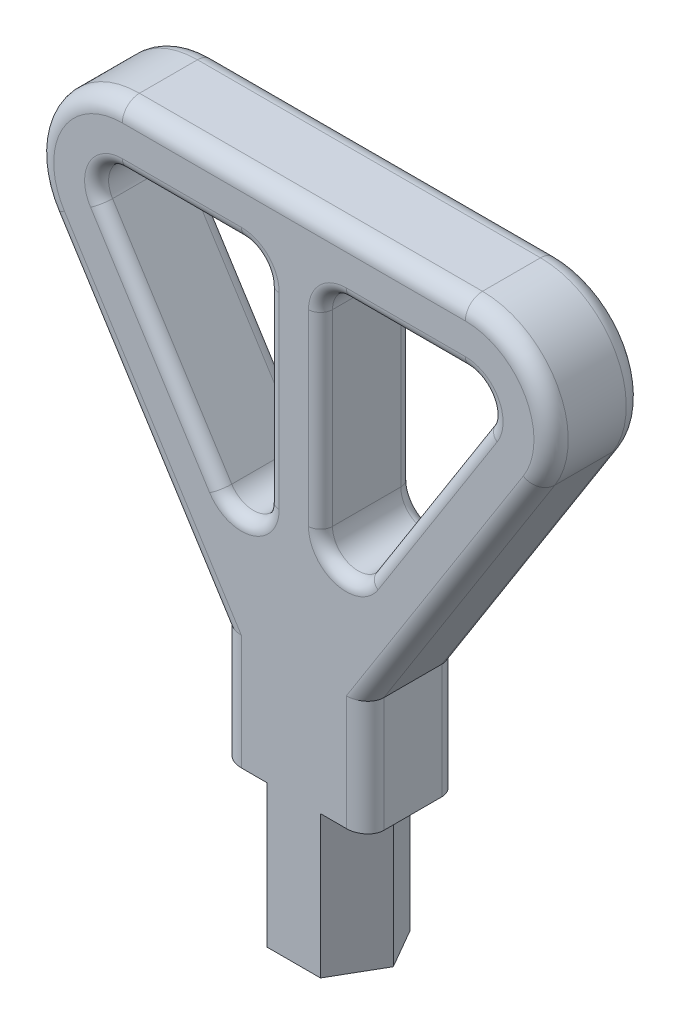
from build123d import *

# Parameters (mm, degrees)
BOSS_EXTRUDE1_DEPTH             = 10.541
BOSS_EXTRUDE2_DEPTH             = 14.859
BOSS_EXTRUDE3_REACH             = 28.19
BOSS_EXTRUDE3_DIRECTION_2_REACH = 28.19
CHAMFER2_SIZE                   = 0.4
CHAMFER2_SIZE2                  = 0.542878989
BOSS_EXTRUDE4_DEPTH             = 14.859
BOSS_EXTRUDE5_START             = 14.859
BOSS_EXTRUDE5_DEPTH             = 14.859
BOSS_EXTRUDE7_DEPTH             = 6.835
FILLET1_R                       = 1.27
CUT_EXTRUDE1_DEPTH              = 33.477372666
CUT_EXTRUDE1_DEPTH_BACK         = 33.477372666
FILLET2_R                       = 0.889
BOSS_EXTRUDE8_DEPTH             = 8.509
BOSS_EXTRUDE9_DEPTH             = 8.509


with BuildPart() as part:
    # Sketch1 → Boss-Extrude1 (new body)
    with BuildSketch(Plane(origin=(0, 0, 0), x_dir=(1, 0, 0), z_dir=(0, 1, 0))):
        Polygon((-1.973094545, -3.4175), (1.973094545, -3.4175), (3.94618909, 0), (1.973094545, 3.4175), (-1.973094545, 3.4175), (-3.94618909, 0), align=None)
    extrude(amount=BOSS_EXTRUDE1_DEPTH)

    # Sketch2 → Boss-Extrude2 (add)
    with BuildSketch(Plane(origin=(0, 10.541, 0), x_dir=(1, 0, 0), z_dir=(0, 1, 0))):
        with BuildLine():
            Line((1.973094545, -3.4175), (-1.973094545, -3.4175))
            ThreePointArc((-1.973094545, -3.4175), (-5.390594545, 0), (-1.973094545, 3.4175))
            Line((-1.973094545, 3.4175), (1.973094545, 3.4175))
            ThreePointArc((1.973094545, 3.4175), (5.390594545, 0), (1.973094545, -3.4175))
        make_face()
    extrude(amount=BOSS_EXTRUDE2_DEPTH)

    # Boss-Extrude3: up to this face of the body (flat: up to its plane)
    boss_extrude3_end = Plane(part.part.faces().sort_by_distance((0, 12.7, 3.4175))[0])
    # Sketch3 → Boss-Extrude3 (add, up to the picked face)
    with BuildSketch(Plane.XY, mode=Mode.PRIVATE) as boss_extrude3_sk1:
        with BuildLine():
            Line((12.7, 12.7), (-12.7, 12.7))
            ThreePointArc((-12.7, 12.7), (-19.05, 19.05), (-12.7, 25.4))
            Line((-12.7, 25.4), (12.7, 25.4))
            ThreePointArc((12.7, 25.4), (19.05, 19.05), (12.7, 12.7))
        make_face()
    boss_extrude3_tool1 = split(extrude(boss_extrude3_sk1.sketch, amount=BOSS_EXTRUDE3_REACH, mode=Mode.PRIVATE), bisect_by=boss_extrude3_end, keep=Keep.BOTH, mode=Mode.PRIVATE)
    add(boss_extrude3_tool1.solids().sort_by(Axis((0, 19.05, 0), (0, 0, 1)))[0])

    # Boss-Extrude3 direction 2: up to this face of the body (flat: up to its plane)
    boss_extrude3_direction_2_end = Plane(part.part.faces().sort_by_distance((0, 12.7, -3.4175))[0])
    # Sketch3 → Boss-Extrude3 direction 2 (add, up to the picked face)
    with BuildSketch(Plane.XY, mode=Mode.PRIVATE) as boss_extrude3_direction_2_sk1:
        with BuildLine():
            Line((12.7, 12.7), (-12.7, 12.7))
            ThreePointArc((-12.7, 12.7), (-19.05, 19.05), (-12.7, 25.4))
            Line((-12.7, 25.4), (12.7, 25.4))
            ThreePointArc((12.7, 25.4), (19.05, 19.05), (12.7, 12.7))
        make_face()
    boss_extrude3_direction_2_tool1 = split(extrude(boss_extrude3_direction_2_sk1.sketch, amount=-BOSS_EXTRUDE3_DIRECTION_2_REACH, mode=Mode.PRIVATE), bisect_by=boss_extrude3_direction_2_end, keep=Keep.BOTH, mode=Mode.PRIVATE)
    add(boss_extrude3_direction_2_tool1.solids().sort_by(Axis((0, 19.05, 0), (0, 0, -1)))[0])

    # Chamfer2
    chamfer2_edges = [part.edges().sort_by_distance(p)[0] for p in [
        (-1.973094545, 5.2705, -3.4175),
        (1.973094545, 5.2705, -3.4175),
    ]]
    chamfer2_side = [part.faces().sort_by_distance(p)[0] for p in [
        (0, 17.775441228, -3.4175),
    ]]
    chamfer(chamfer2_edges, length=CHAMFER2_SIZE, length2=CHAMFER2_SIZE2, reference=chamfer2_side[0])

    # Sketch4 → Boss-Extrude4 (add)
    with BuildSketch(Plane.XZ):
        Polygon((-1.573094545, -3.4175), (1.573094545, -3.4175), (2.244534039, -2.947353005), (3.94618909, 0), (1.973094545, 3.4175), (-1.973094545, 3.4175), (-3.94618909, 0), (-2.244534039, -2.947353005), align=None)
    extrude(amount=BOSS_EXTRUDE4_DEPTH)

    # Sketch5 → Boss-Extrude5 (add)
    with BuildSketch(Plane.XZ.offset(-10.541).offset(BOSS_EXTRUDE5_START)):
        with BuildLine():
            Line((-1.973094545, 3.4175), (1.973094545, 3.4175))
            ThreePointArc((1.973094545, 3.4175), (5.390594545, 0), (1.973094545, -3.4175))
            Line((1.973094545, -3.4175), (-1.973094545, -3.4175))
            ThreePointArc((-1.973094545, -3.4175), (-5.390594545, 0), (-1.973094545, 3.4175))
        make_face()
    extrude(amount=-BOSS_EXTRUDE5_DEPTH)

    # Sketch6 → Boss-Extrude7 (add)
    with BuildSketch(Plane.XY.offset(3.4175)):
        Polygon((-5.390594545, -4.318), (5.390594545, -4.318), (18.061434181, 15.647423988), (-18.061434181, 15.647423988), align=None)
    extrude(amount=-BOSS_EXTRUDE7_DEPTH)

    # Fillet1
    fillet1_edges = [part.edges().sort_by_distance(p)[0] for p in [
        (-18.264569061, 22.109096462, 3.4175),
        (-18.264569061, 22.109096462, -3.4175),
        (11.726014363, 5.664711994, 3.4175),
        (-11.726014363, 5.664711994, -3.4175),
        (-11.726014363, 5.664711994, 3.4175),
        (11.726014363, 5.664711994, -3.4175),
        (0, 25.4, -3.4175),
        (0, 25.4, 3.4175),
        (18.264569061, 22.109096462, 3.4175),
        (18.264569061, 22.109096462, -3.4175),
    ]]
    fillet(fillet1_edges, radius=FILLET1_R)

    # Sketch7 → Cut-Extrude1 (cut, two sides: drawn at the far end of the back side and taken through both)
    with BuildSketch(Plane.XY.offset(3.4175).offset(-CUT_EXTRUDE1_DEPTH_BACK)):
        with BuildLine():
            Line((-1.973094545, 5.149336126), (-1.973094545, 19.05))
            ThreePointArc((-1.973094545, 19.05), (-2.531056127, 20.397038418), (-3.878094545, 20.955))
            Line((-3.878094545, 20.955), (-12.7, 20.955))
            ThreePointArc((-12.7, 20.955), (-14.369370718, 19.967728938), (-14.308430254, 18.029227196))
            Line((-14.308430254, 18.029227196), (-5.486524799, 4.128563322))
            ThreePointArc((-5.486524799, 4.128563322), (-3.346603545, 3.319980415), (-1.973094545, 5.149336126))
        make_face()
        with BuildLine():
            Line((14.308430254, 18.029227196), (5.486524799, 4.128563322))
            ThreePointArc((5.486524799, 4.128563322), (3.346603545, 3.319980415), (1.973094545, 5.149336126))
            Line((1.973094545, 5.149336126), (1.973094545, 19.05))
            ThreePointArc((1.973094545, 19.05), (2.531056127, 20.397038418), (3.878094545, 20.955))
            Line((3.878094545, 20.955), (12.7, 20.955))
            ThreePointArc((12.7, 20.955), (14.369370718, 19.967728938), (14.308430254, 18.029227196))
        make_face()
    extrude(amount=CUT_EXTRUDE1_DEPTH + CUT_EXTRUDE1_DEPTH_BACK, mode=Mode.SUBTRACT)

    # Fillet2
    fillet2_edges = [part.edges().sort_by_distance(p)[0] for p in [
        (-3.346603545, 3.319980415, -3.4175),
        (-9.897477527, 11.078895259, -3.4175),
        (-14.369370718, 19.967728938, -3.4175),
        (-8.289047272, 20.955, -3.4175),
        (-2.531056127, 20.397038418, -3.4175),
        (-1.973094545, 12.099668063, -3.4175),
        (-3.346603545, 3.319980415, 3.4175),
        (-1.973094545, 12.099668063, 3.4175),
        (-2.531056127, 20.397038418, 3.4175),
        (-8.289047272, 20.955, 3.4175),
        (-14.369370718, 19.967728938, 3.4175),
        (-9.897477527, 11.078895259, 3.4175),
        (14.369370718, 19.967728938, -3.4175),
        (9.897477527, 11.078895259, -3.4175),
        (3.346603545, 3.319980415, -3.4175),
        (1.973094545, 12.099668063, -3.4175),
        (2.531056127, 20.397038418, -3.4175),
        (8.289047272, 20.955, -3.4175),
        (14.369370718, 19.967728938, 3.4175),
        (8.289047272, 20.955, 3.4175),
        (2.531056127, 20.397038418, 3.4175),
        (1.973094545, 12.099668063, 3.4175),
        (3.346603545, 3.319980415, 3.4175),
        (9.897477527, 11.078895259, 3.4175),
    ]]
    fillet(fillet2_edges, radius=FILLET2_R)

    # Sketch8 → Boss-Extrude8 (add)
    with BuildSketch(Plane.XZ.offset(14.859)):
        Polygon((-2.244534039, -2.947353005), (-1.573094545, -3.4175), (1.573094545, -3.4175), (2.244534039, -2.947353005), (3.94618909, 0), (1.973094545, 3.4175), (-1.973094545, 3.4175), (-3.94618909, 0), align=None)
    extrude(amount=BOSS_EXTRUDE8_DEPTH)

    # Sketch9 → Boss-Extrude9 (add)
    with BuildSketch(Plane.XZ.offset(4.318)):
        with BuildLine():
            Line((-5.390594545, 2.1475), (-5.390594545, -2.1475))
            add(Edge.make_bspline(
                [(-5.390594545, -2.1475), (-5.390594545, -3.4175), (-3.886426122, -3.4175)],
                knots=[3.141592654, 3.141592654, 3.141592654, 4.71238898, 4.71238898, 4.71238898], degree=2, weights=[1, 0.707106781, 1]))
            Line((-3.886426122, -3.4175), (-1.573094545, -3.4175))
            Line((-1.573094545, -3.4175), (-2.244534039, -2.947353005))
            Line((-2.244534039, -2.947353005), (-3.94618909, 0))
            Line((-3.94618909, 0), (-1.973094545, 3.4175))
            Line((-1.973094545, 3.4175), (-3.886426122, 3.4175))
            add(Edge.make_bspline(
                [(-3.886426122, 3.4175), (-5.390594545, 3.4175), (-5.390594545, 2.1475)],
                knots=[4.71238898, 4.71238898, 4.71238898, 6.283185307, 6.283185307, 6.283185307], degree=2, weights=[1, 0.707106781, 1]))
        make_face()
        with BuildLine():
            Line((1.573094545, -3.4175), (3.886426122, -3.4175))
            add(Edge.make_bspline(
                [(3.886426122, -3.4175), (5.390594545, -3.4175), (5.390594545, -2.1475)],
                knots=[4.71238898, 4.71238898, 4.71238898, 6.283185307, 6.283185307, 6.283185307], degree=2, weights=[1, 0.707106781, 1]))
            Line((5.390594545, -2.1475), (5.390594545, 2.1475))
            add(Edge.make_bspline(
                [(5.390594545, 2.1475), (5.390594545, 3.4175), (3.886426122, 3.4175)],
                knots=[3.141592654, 3.141592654, 3.141592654, 4.71238898, 4.71238898, 4.71238898], degree=2, weights=[1, 0.707106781, 1]))
            Line((3.886426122, 3.4175), (1.973094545, 3.4175))
            Line((1.973094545, 3.4175), (3.94618909, 0))
            Line((3.94618909, 0), (2.244534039, -2.947353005))
            Line((2.244534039, -2.947353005), (1.573094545, -3.4175))
        make_face()
    extrude(amount=BOSS_EXTRUDE9_DEPTH)


solid = part.part
